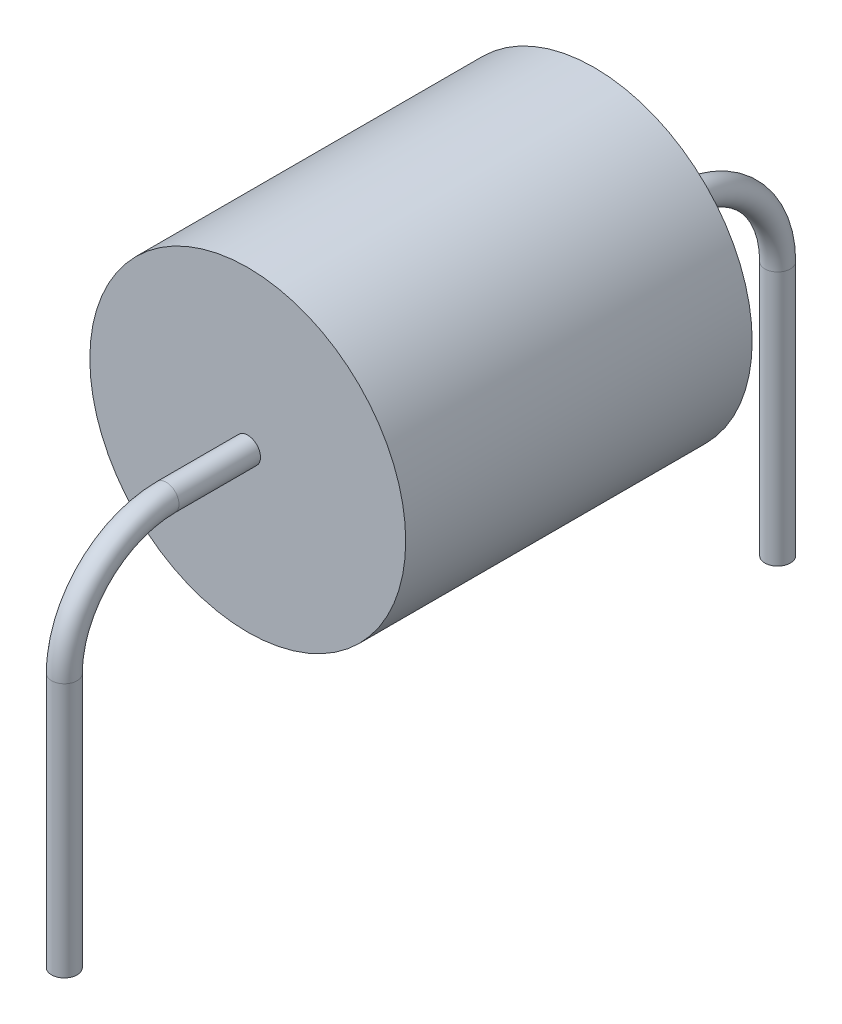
ISO-10303-21;
HEADER;
FILE_DESCRIPTION(('STEP AP214'),'2;1');
FILE_NAME('part.step','',(''),(''),'','','');
FILE_SCHEMA(('AUTOMOTIVE_DESIGN { 1 0 10303 214 1 1 1 1 }'));
ENDSEC;
DATA;
#1=APPLICATION_CONTEXT('core data for automotive mechanical design processes');
#2=APPLICATION_PROTOCOL_DEFINITION('international standard','automotive_design',2000,#1);
#3=PRODUCT_CONTEXT('',#1,'mechanical');
#4=PRODUCT('Part','Part','',(#3));
#5=PRODUCT_RELATED_PRODUCT_CATEGORY('part','',(#4));
#6=PRODUCT_DEFINITION_FORMATION('','',#4);
#7=PRODUCT_DEFINITION_CONTEXT('part definition',#1,'design');
#8=PRODUCT_DEFINITION('design','',#6,#7);
#9=PRODUCT_DEFINITION_SHAPE('','',#8);
#10=(LENGTH_UNIT() NAMED_UNIT(*) SI_UNIT(.MILLI.,.METRE.));
#11=(NAMED_UNIT(*) PLANE_ANGLE_UNIT() SI_UNIT($,.RADIAN.));
#12=(NAMED_UNIT(*) SI_UNIT($,.STERADIAN.) SOLID_ANGLE_UNIT());
#13=UNCERTAINTY_MEASURE_WITH_UNIT(LENGTH_MEASURE(1.E-05),#10,'distance_accuracy_value','');
#14=(GEOMETRIC_REPRESENTATION_CONTEXT(3) GLOBAL_UNCERTAINTY_ASSIGNED_CONTEXT((#13)) GLOBAL_UNIT_ASSIGNED_CONTEXT((#10,
#11,#12)) REPRESENTATION_CONTEXT('',''));
#15=CARTESIAN_POINT('',(0.,0.,0.));
#16=DIRECTION('',(0.,0.,1.));
#17=DIRECTION('',(1.,0.,0.));
#18=AXIS2_PLACEMENT_3D('',#15,#16,#17);
#19=CARTESIAN_POINT('',(2.82805449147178,-1.27,-47.3360399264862));
#20=DIRECTION('',(0.,1.,0.));
#21=DIRECTION('',(0.,0.,1.));
#22=AXIS2_PLACEMENT_3D('',#19,#20,#21);
#23=PLANE('',#22);
#24=CARTESIAN_POINT('',(3.175,-1.27,-46.99));
#25=DIRECTION('',(0.,1.,0.));
#26=DIRECTION('',(0.,0.,1.));
#27=AXIS2_PLACEMENT_3D('',#24,#25,#26);
#28=CIRCLE('',#27,0.317500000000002);
#29=CARTESIAN_POINT('',(3.175,-1.27,-46.6725));
#30=VERTEX_POINT('',#29);
#31=EDGE_CURVE('E18',#30,#30,#28,.F.);
#32=ORIENTED_EDGE('',*,*,#31,.T.);
#33=EDGE_LOOP('',(#32));
#34=FACE_BOUND('',#33,.T.);
#35=ADVANCED_FACE('F14',(#34),#23,.F.);
#36=CARTESIAN_POINT('',(3.175,-1.27,-46.99));
#37=DIRECTION('',(0.,1.,0.));
#38=DIRECTION('',(0.,0.,1.));
#39=AXIS2_PLACEMENT_3D('',#36,#37,#38);
#40=CYLINDRICAL_SURFACE('',#39,0.317500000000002);
#41=CARTESIAN_POINT('',(3.175,5.07999999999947,-46.99));
#42=DIRECTION('',(0.,-1.,2.07068036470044E-13));
#43=DIRECTION('',(-0.0897685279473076,-2.06232031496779E-13,-0.995962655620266));
#44=AXIS2_PLACEMENT_3D('',#41,#42,#43);
#45=CIRCLE('',#44,0.3175);
#46=CARTESIAN_POINT('',(3.14649849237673,5.07999999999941,-47.3062181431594));
#47=VERTEX_POINT('',#46);
#48=EDGE_CURVE('E30',#47,#47,#45,.T.);
#49=ORIENTED_EDGE('',*,*,#48,.T.);
#50=EDGE_LOOP('',(#49));
#51=FACE_BOUND('',#50,.T.);
#52=ORIENTED_EDGE('',*,*,#31,.F.);
#53=EDGE_LOOP('',(#52));
#54=FACE_BOUND('',#53,.T.);
#55=ADVANCED_FACE('F53',(#51,#54),#40,.T.);
#56=CARTESIAN_POINT('',(2.82805449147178,-1.27,-28.8639600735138));
#57=DIRECTION('',(0.,-1.,0.));
#58=DIRECTION('',(0.,0.,-1.));
#59=AXIS2_PLACEMENT_3D('',#56,#57,#58);
#60=PLANE('',#59);
#61=CARTESIAN_POINT('',(3.175,-1.2699999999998,-29.21));
#62=DIRECTION('',(0.,-1.,0.));
#63=DIRECTION('',(0.,0.,-1.));
#64=AXIS2_PLACEMENT_3D('',#61,#62,#63);
#65=CIRCLE('',#64,0.317499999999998);
#66=CARTESIAN_POINT('',(3.175,-1.2699999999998,-29.5275));
#67=VERTEX_POINT('',#66);
#68=EDGE_CURVE('E39',#67,#67,#65,.T.);
#69=ORIENTED_EDGE('',*,*,#68,.T.);
#70=EDGE_LOOP('',(#69));
#71=FACE_BOUND('',#70,.T.);
#72=ADVANCED_FACE('F55',(#71),#60,.T.);
#73=CARTESIAN_POINT('',(3.175,5.08,-44.45));
#74=DIRECTION('',(1.,0.,0.));
#75=DIRECTION('',(0.,0.,1.));
#76=AXIS2_PLACEMENT_3D('',#73,#74,#75);
#77=TOROIDAL_SURFACE('',#76,2.54,0.3175);
#78=CARTESIAN_POINT('',(3.175,7.62,-44.45));
#79=DIRECTION('',(0.,0.,1.));
#80=DIRECTION('',(0.,-1.,0.));
#81=AXIS2_PLACEMENT_3D('',#78,#79,#80);
#82=CIRCLE('',#81,0.317500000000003);
#83=CARTESIAN_POINT('',(3.175,7.3025,-44.45));
#84=VERTEX_POINT('',#83);
#85=EDGE_CURVE('E41',#84,#84,#82,.F.);
#86=ORIENTED_EDGE('',*,*,#85,.T.);
#87=EDGE_LOOP('',(#86));
#88=FACE_BOUND('',#87,.T.);
#89=ORIENTED_EDGE('',*,*,#48,.F.);
#90=EDGE_LOOP('',(#89));
#91=FACE_BOUND('',#90,.T.);
#92=ADVANCED_FACE('F62',(#88,#91),#77,.T.);
#93=CARTESIAN_POINT('',(3.175,5.07999999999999,-29.21));
#94=DIRECTION('',(0.,-1.,0.));
#95=DIRECTION('',(0.,0.,-1.));
#96=AXIS2_PLACEMENT_3D('',#93,#94,#95);
#97=CYLINDRICAL_SURFACE('',#96,0.317499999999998);
#98=ORIENTED_EDGE('',*,*,#68,.F.);
#99=EDGE_LOOP('',(#98));
#100=FACE_BOUND('',#99,.T.);
#101=CARTESIAN_POINT('',(3.175,5.08000000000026,-29.21));
#102=DIRECTION('',(0.,1.,-1.03212393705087E-13));
#103=DIRECTION('',(0.0897685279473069,-1.02795689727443E-13,-0.995962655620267));
#104=AXIS2_PLACEMENT_3D('',#101,#102,#103);
#105=CIRCLE('',#104,0.3175);
#106=CARTESIAN_POINT('',(3.20350150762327,5.08000000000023,-29.5262181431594));
#107=VERTEX_POINT('',#106);
#108=EDGE_CURVE('E38',#107,#107,#105,.F.);
#109=ORIENTED_EDGE('',*,*,#108,.T.);
#110=EDGE_LOOP('',(#109));
#111=FACE_BOUND('',#110,.T.);
#112=ADVANCED_FACE('F101',(#100,#111),#97,.T.);
#113=CARTESIAN_POINT('',(3.175,7.62,-44.45));
#114=DIRECTION('',(0.,0.,1.));
#115=DIRECTION('',(1.,0.,0.));
#116=AXIS2_PLACEMENT_3D('',#113,#114,#115);
#117=CYLINDRICAL_SURFACE('',#116,0.317500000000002);
#118=ORIENTED_EDGE('',*,*,#85,.F.);
#119=EDGE_LOOP('',(#118));
#120=FACE_BOUND('',#119,.T.);
#121=CARTESIAN_POINT('',(3.175,7.62,-42.4180000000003));
#122=DIRECTION('',(0.,0.,1.));
#123=DIRECTION('',(1.,0.,0.));
#124=AXIS2_PLACEMENT_3D('',#121,#122,#123);
#125=CIRCLE('',#124,0.317500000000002);
#126=CARTESIAN_POINT('',(3.4925,7.62,-42.4180000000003));
#127=VERTEX_POINT('',#126);
#128=EDGE_CURVE('E36',#127,#127,#125,.T.);
#129=ORIENTED_EDGE('',*,*,#128,.F.);
#130=EDGE_LOOP('',(#129));
#131=FACE_BOUND('',#130,.T.);
#132=ADVANCED_FACE('F92',(#120,#131),#117,.T.);
#133=CARTESIAN_POINT('',(3.175,5.08,-31.75));
#134=DIRECTION('',(1.,0.,0.));
#135=DIRECTION('',(0.,-1.,0.));
#136=AXIS2_PLACEMENT_3D('',#133,#134,#135);
#137=TOROIDAL_SURFACE('',#136,2.54,0.3175);
#138=ORIENTED_EDGE('',*,*,#108,.F.);
#139=EDGE_LOOP('',(#138));
#140=FACE_BOUND('',#139,.T.);
#141=CARTESIAN_POINT('',(3.175,7.62,-31.7500000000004));
#142=DIRECTION('',(0.,0.,1.));
#143=DIRECTION('',(0.,-1.,0.));
#144=AXIS2_PLACEMENT_3D('',#141,#142,#143);
#145=CIRCLE('',#144,0.317500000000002);
#146=CARTESIAN_POINT('',(3.175,7.3025,-31.7500000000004));
#147=VERTEX_POINT('',#146);
#148=EDGE_CURVE('E35',#147,#147,#145,.T.);
#149=ORIENTED_EDGE('',*,*,#148,.T.);
#150=EDGE_LOOP('',(#149));
#151=FACE_BOUND('',#150,.T.);
#152=ADVANCED_FACE('F85',(#140,#151),#137,.T.);
#153=CARTESIAN_POINT('',(7.26948,11.71448,-42.418));
#154=DIRECTION('',(0.,0.,-1.));
#155=DIRECTION('',(0.,-1.,0.));
#156=AXIS2_PLACEMENT_3D('',#153,#154,#155);
#157=PLANE('',#156);
#158=ORIENTED_EDGE('',*,*,#128,.T.);
#159=EDGE_LOOP('',(#158));
#160=FACE_BOUND('',#159,.T.);
#161=CARTESIAN_POINT('',(3.175,7.62,-42.4179999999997));
#162=DIRECTION('',(0.,0.,-1.));
#163=DIRECTION('',(-1.,0.,0.));
#164=AXIS2_PLACEMENT_3D('',#161,#162,#163);
#165=CIRCLE('',#164,3.937);
#166=CARTESIAN_POINT('',(-0.762000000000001,7.62,-42.4179999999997));
#167=VERTEX_POINT('',#166);
#168=EDGE_CURVE('E27',#167,#167,#165,.T.);
#169=ORIENTED_EDGE('',*,*,#168,.T.);
#170=EDGE_LOOP('',(#169));
#171=FACE_BOUND('',#170,.T.);
#172=ADVANCED_FACE('F79',(#160,#171),#157,.T.);
#173=CARTESIAN_POINT('',(3.175,7.62,-33.782));
#174=DIRECTION('',(0.,0.,-1.));
#175=DIRECTION('',(-1.,0.,0.));
#176=AXIS2_PLACEMENT_3D('',#173,#174,#175);
#177=CYLINDRICAL_SURFACE('',#176,3.937);
#178=ORIENTED_EDGE('',*,*,#168,.F.);
#179=EDGE_LOOP('',(#178));
#180=FACE_BOUND('',#179,.T.);
#181=CARTESIAN_POINT('',(3.175,7.62,-33.782));
#182=DIRECTION('',(0.,0.,-1.));
#183=DIRECTION('',(-1.,0.,0.));
#184=AXIS2_PLACEMENT_3D('',#181,#182,#183);
#185=CIRCLE('',#184,3.937);
#186=CARTESIAN_POINT('',(-0.762000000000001,7.62,-33.782));
#187=VERTEX_POINT('',#186);
#188=EDGE_CURVE('E22',#187,#187,#185,.T.);
#189=ORIENTED_EDGE('',*,*,#188,.T.);
#190=EDGE_LOOP('',(#189));
#191=FACE_BOUND('',#190,.T.);
#192=ADVANCED_FACE('F72',(#180,#191),#177,.T.);
#193=CARTESIAN_POINT('',(3.175,7.62,-33.7819999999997));
#194=DIRECTION('',(0.,0.,1.));
#195=DIRECTION('',(1.,0.,0.));
#196=AXIS2_PLACEMENT_3D('',#193,#194,#195);
#197=CYLINDRICAL_SURFACE('',#196,0.317500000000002);
#198=ORIENTED_EDGE('',*,*,#148,.F.);
#199=EDGE_LOOP('',(#198));
#200=FACE_BOUND('',#199,.T.);
#201=CARTESIAN_POINT('',(3.175,7.62,-33.7819999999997));
#202=DIRECTION('',(0.,0.,1.));
#203=DIRECTION('',(1.,0.,0.));
#204=AXIS2_PLACEMENT_3D('',#201,#202,#203);
#205=CIRCLE('',#204,0.317500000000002);
#206=CARTESIAN_POINT('',(3.4925,7.62,-33.7819999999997));
#207=VERTEX_POINT('',#206);
#208=EDGE_CURVE('E10',#207,#207,#205,.T.);
#209=ORIENTED_EDGE('',*,*,#208,.T.);
#210=EDGE_LOOP('',(#209));
#211=FACE_BOUND('',#210,.T.);
#212=ADVANCED_FACE('F67',(#200,#211),#197,.T.);
#213=CARTESIAN_POINT('',(7.26948,11.71448,-33.782));
#214=DIRECTION('',(0.,0.,-1.));
#215=DIRECTION('',(0.,-1.,0.));
#216=AXIS2_PLACEMENT_3D('',#213,#214,#215);
#217=PLANE('',#216);
#218=ORIENTED_EDGE('',*,*,#208,.F.);
#219=EDGE_LOOP('',(#218));
#220=FACE_BOUND('',#219,.T.);
#221=ORIENTED_EDGE('',*,*,#188,.F.);
#222=EDGE_LOOP('',(#221));
#223=FACE_BOUND('',#222,.T.);
#224=ADVANCED_FACE('F16',(#220,#223),#217,.F.);
#225=CLOSED_SHELL('',(#35,#55,#72,#92,#112,#132,#152,#172,#192,#212,#224));
#226=MANIFOLD_SOLID_BREP('B1',#225);
#227=ADVANCED_BREP_SHAPE_REPRESENTATION('',(#18,#226),#14);
#228=SHAPE_DEFINITION_REPRESENTATION(#9,#227);
ENDSEC;
END-ISO-10303-21;
